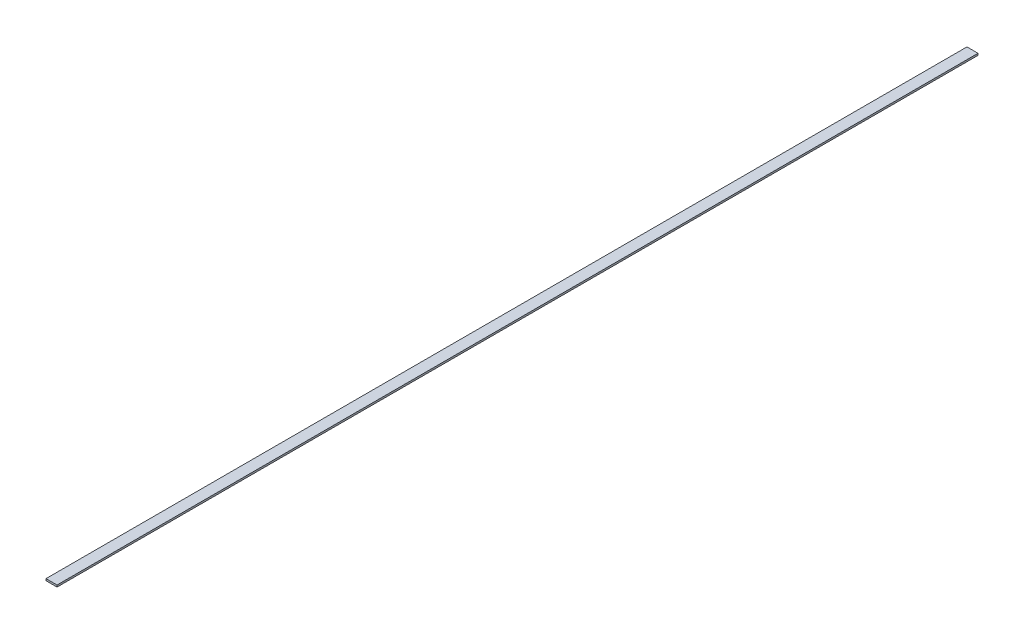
ISO-10303-21;
HEADER;
FILE_DESCRIPTION(('STEP AP214'),'2;1');
FILE_NAME('part.step','',(''),(''),'','','');
FILE_SCHEMA(('AUTOMOTIVE_DESIGN { 1 0 10303 214 1 1 1 1 }'));
ENDSEC;
DATA;
#1=APPLICATION_CONTEXT('core data for automotive mechanical design processes');
#2=APPLICATION_PROTOCOL_DEFINITION('international standard','automotive_design',2000,#1);
#3=PRODUCT_CONTEXT('',#1,'mechanical');
#4=PRODUCT('Part','Part','',(#3));
#5=PRODUCT_RELATED_PRODUCT_CATEGORY('part','',(#4));
#6=PRODUCT_DEFINITION_FORMATION('','',#4);
#7=PRODUCT_DEFINITION_CONTEXT('part definition',#1,'design');
#8=PRODUCT_DEFINITION('design','',#6,#7);
#9=PRODUCT_DEFINITION_SHAPE('','',#8);
#10=(LENGTH_UNIT() NAMED_UNIT(*) SI_UNIT(.MILLI.,.METRE.));
#11=(NAMED_UNIT(*) PLANE_ANGLE_UNIT() SI_UNIT($,.RADIAN.));
#12=(NAMED_UNIT(*) SI_UNIT($,.STERADIAN.) SOLID_ANGLE_UNIT());
#13=UNCERTAINTY_MEASURE_WITH_UNIT(LENGTH_MEASURE(1.E-05),#10,'distance_accuracy_value','');
#14=(GEOMETRIC_REPRESENTATION_CONTEXT(3) GLOBAL_UNCERTAINTY_ASSIGNED_CONTEXT((#13)) GLOBAL_UNIT_ASSIGNED_CONTEXT((#10,
#11,#12)) REPRESENTATION_CONTEXT('',''));
#15=CARTESIAN_POINT('',(0.,0.,0.));
#16=DIRECTION('',(0.,0.,1.));
#17=DIRECTION('',(1.,0.,0.));
#18=AXIS2_PLACEMENT_3D('',#15,#16,#17);
#19=CARTESIAN_POINT('',(-14.,9.09836065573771,1000.));
#20=DIRECTION('',(1.,0.,0.));
#21=DIRECTION('',(0.,1.,0.));
#22=AXIS2_PLACEMENT_3D('',#19,#20,#21);
#23=PLANE('',#22);
#24=DIRECTION('',(0.,-1.,0.));
#25=VECTOR('',#24,1.);
#26=CARTESIAN_POINT('',(-14.,9.09836065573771,0.));
#27=LINE('',#26,#25);
#28=CARTESIAN_POINT('',(-14.,9.09836065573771,0.));
#29=VERTEX_POINT('',#28);
#30=CARTESIAN_POINT('',(-14.,7.09836065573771,0.));
#31=VERTEX_POINT('',#30);
#32=EDGE_CURVE('E113',#29,#31,#27,.T.);
#33=ORIENTED_EDGE('',*,*,#32,.T.);
#34=DIRECTION('',(0.,0.,-1.));
#35=VECTOR('',#34,1.);
#36=CARTESIAN_POINT('',(-14.,7.09836065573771,1000.));
#37=LINE('',#36,#35);
#38=CARTESIAN_POINT('',(-14.,7.09836065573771,1000.));
#39=VERTEX_POINT('',#38);
#40=EDGE_CURVE('E11',#39,#31,#37,.T.);
#41=ORIENTED_EDGE('',*,*,#40,.F.);
#42=DIRECTION('',(0.,-1.,0.));
#43=VECTOR('',#42,1.);
#44=CARTESIAN_POINT('',(-14.,9.09836065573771,1000.));
#45=LINE('',#44,#43);
#46=CARTESIAN_POINT('',(-14.,9.09836065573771,1000.));
#47=VERTEX_POINT('',#46);
#48=EDGE_CURVE('E97',#47,#39,#45,.T.);
#49=ORIENTED_EDGE('',*,*,#48,.F.);
#50=DIRECTION('',(0.,0.,-1.));
#51=VECTOR('',#50,1.);
#52=CARTESIAN_POINT('',(-14.,9.09836065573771,1000.));
#53=LINE('',#52,#51);
#54=EDGE_CURVE('E109',#47,#29,#53,.T.);
#55=ORIENTED_EDGE('',*,*,#54,.T.);
#56=EDGE_LOOP('',(#33,#41,#49,#55));
#57=FACE_BOUND('',#56,.T.);
#58=ADVANCED_FACE('F45',(#57),#23,.F.);
#59=CARTESIAN_POINT('',(-14.,7.09836065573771,1000.));
#60=DIRECTION('',(0.,1.,0.));
#61=DIRECTION('',(0.,0.,1.));
#62=AXIS2_PLACEMENT_3D('',#59,#60,#61);
#63=PLANE('',#62);
#64=DIRECTION('',(1.,0.,0.));
#65=VECTOR('',#64,1.);
#66=CARTESIAN_POINT('',(-14.,7.09836065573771,0.));
#67=LINE('',#66,#65);
#68=CARTESIAN_POINT('',(-2.,7.09836065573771,0.));
#69=VERTEX_POINT('',#68);
#70=EDGE_CURVE('E102',#31,#69,#67,.T.);
#71=ORIENTED_EDGE('',*,*,#70,.T.);
#72=DIRECTION('',(0.,0.,-1.));
#73=VECTOR('',#72,1.);
#74=CARTESIAN_POINT('',(-2.,7.09836065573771,1000.));
#75=LINE('',#74,#73);
#76=CARTESIAN_POINT('',(-2.,7.09836065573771,1000.));
#77=VERTEX_POINT('',#76);
#78=EDGE_CURVE('E54',#77,#69,#75,.T.);
#79=ORIENTED_EDGE('',*,*,#78,.F.);
#80=DIRECTION('',(1.,0.,0.));
#81=VECTOR('',#80,1.);
#82=CARTESIAN_POINT('',(-14.,7.09836065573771,1000.));
#83=LINE('',#82,#81);
#84=EDGE_CURVE('E92',#39,#77,#83,.T.);
#85=ORIENTED_EDGE('',*,*,#84,.F.);
#86=ORIENTED_EDGE('',*,*,#40,.T.);
#87=EDGE_LOOP('',(#71,#79,#85,#86));
#88=FACE_BOUND('',#87,.T.);
#89=ADVANCED_FACE('F101',(#88),#63,.F.);
#90=CARTESIAN_POINT('',(-2.,9.09836065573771,1000.));
#91=DIRECTION('',(-1.,0.,0.));
#92=DIRECTION('',(0.,0.,1.));
#93=AXIS2_PLACEMENT_3D('',#90,#91,#92);
#94=PLANE('',#93);
#95=DIRECTION('',(0.,1.,0.));
#96=VECTOR('',#95,1.);
#97=CARTESIAN_POINT('',(-2.,9.09836065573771,0.));
#98=LINE('',#97,#96);
#99=CARTESIAN_POINT('',(-2.,9.09836065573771,0.));
#100=VERTEX_POINT('',#99);
#101=EDGE_CURVE('E79',#69,#100,#98,.T.);
#102=ORIENTED_EDGE('',*,*,#101,.T.);
#103=DIRECTION('',(0.,0.,-1.));
#104=VECTOR('',#103,1.);
#105=CARTESIAN_POINT('',(-2.,9.09836065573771,1000.));
#106=LINE('',#105,#104);
#107=CARTESIAN_POINT('',(-2.,9.09836065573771,1000.));
#108=VERTEX_POINT('',#107);
#109=EDGE_CURVE('E104',#108,#100,#106,.T.);
#110=ORIENTED_EDGE('',*,*,#109,.F.);
#111=DIRECTION('',(0.,1.,0.));
#112=VECTOR('',#111,1.);
#113=CARTESIAN_POINT('',(-2.,9.09836065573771,1000.));
#114=LINE('',#113,#112);
#115=EDGE_CURVE('E95',#77,#108,#114,.T.);
#116=ORIENTED_EDGE('',*,*,#115,.F.);
#117=ORIENTED_EDGE('',*,*,#78,.T.);
#118=EDGE_LOOP('',(#102,#110,#116,#117));
#119=FACE_BOUND('',#118,.T.);
#120=ADVANCED_FACE('F105',(#119),#94,.F.);
#121=CARTESIAN_POINT('',(-14.,9.09836065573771,1000.));
#122=DIRECTION('',(0.,-1.,0.));
#123=DIRECTION('',(0.,0.,-1.));
#124=AXIS2_PLACEMENT_3D('',#121,#122,#123);
#125=PLANE('',#124);
#126=DIRECTION('',(-1.,0.,0.));
#127=VECTOR('',#126,1.);
#128=CARTESIAN_POINT('',(-14.,9.09836065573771,0.));
#129=LINE('',#128,#127);
#130=EDGE_CURVE('E85',#100,#29,#129,.T.);
#131=ORIENTED_EDGE('',*,*,#130,.T.);
#132=ORIENTED_EDGE('',*,*,#54,.F.);
#133=DIRECTION('',(-1.,0.,0.));
#134=VECTOR('',#133,1.);
#135=CARTESIAN_POINT('',(-14.,9.09836065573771,1000.));
#136=LINE('',#135,#134);
#137=EDGE_CURVE('E62',#108,#47,#136,.T.);
#138=ORIENTED_EDGE('',*,*,#137,.F.);
#139=ORIENTED_EDGE('',*,*,#109,.T.);
#140=EDGE_LOOP('',(#131,#132,#138,#139));
#141=FACE_BOUND('',#140,.T.);
#142=ADVANCED_FACE('F126',(#141),#125,.F.);
#143=CARTESIAN_POINT('',(0.,0.,1000.));
#144=DIRECTION('',(0.,0.,1.));
#145=DIRECTION('',(1.,0.,0.));
#146=AXIS2_PLACEMENT_3D('',#143,#144,#145);
#147=PLANE('',#146);
#148=ORIENTED_EDGE('',*,*,#48,.T.);
#149=ORIENTED_EDGE('',*,*,#84,.T.);
#150=ORIENTED_EDGE('',*,*,#115,.T.);
#151=ORIENTED_EDGE('',*,*,#137,.T.);
#152=EDGE_LOOP('',(#148,#149,#150,#151));
#153=FACE_BOUND('',#152,.T.);
#154=ADVANCED_FACE('F93',(#153),#147,.T.);
#155=CARTESIAN_POINT('',(0.,0.,0.));
#156=DIRECTION('',(0.,0.,1.));
#157=DIRECTION('',(1.,0.,0.));
#158=AXIS2_PLACEMENT_3D('',#155,#156,#157);
#159=PLANE('',#158);
#160=ORIENTED_EDGE('',*,*,#32,.F.);
#161=ORIENTED_EDGE('',*,*,#130,.F.);
#162=ORIENTED_EDGE('',*,*,#101,.F.);
#163=ORIENTED_EDGE('',*,*,#70,.F.);
#164=EDGE_LOOP('',(#160,#161,#162,#163));
#165=FACE_BOUND('',#164,.T.);
#166=ADVANCED_FACE('F129',(#165),#159,.F.);
#167=CLOSED_SHELL('',(#58,#89,#120,#142,#154,#166));
#168=MANIFOLD_SOLID_BREP('B2',#167);
#169=ADVANCED_BREP_SHAPE_REPRESENTATION('',(#18,#168),#14);
#170=SHAPE_DEFINITION_REPRESENTATION(#9,#169);
ENDSEC;
END-ISO-10303-21;
